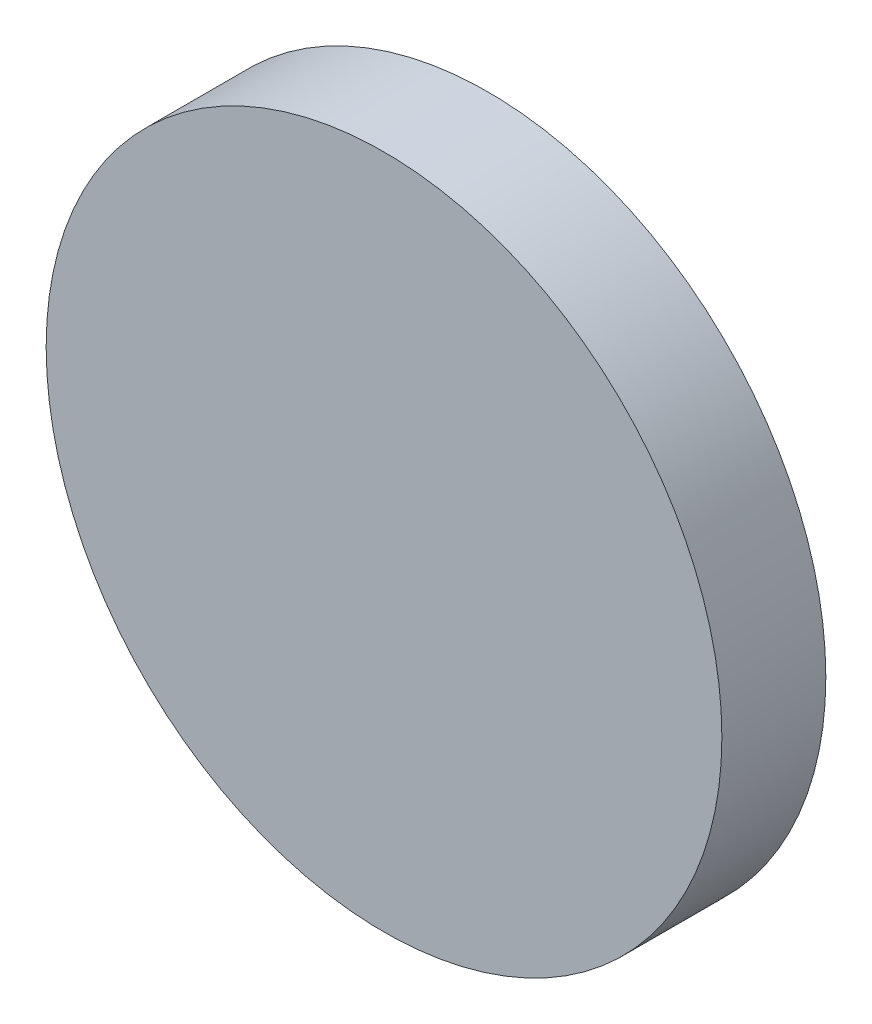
ISO-10303-21;
HEADER;
FILE_DESCRIPTION(('STEP AP214'),'2;1');
FILE_NAME('part.step','',(''),(''),'','','');
FILE_SCHEMA(('AUTOMOTIVE_DESIGN { 1 0 10303 214 1 1 1 1 }'));
ENDSEC;
DATA;
#1=APPLICATION_CONTEXT('core data for automotive mechanical design processes');
#2=APPLICATION_PROTOCOL_DEFINITION('international standard','automotive_design',2000,#1);
#3=PRODUCT_CONTEXT('',#1,'mechanical');
#4=PRODUCT('Part','Part','',(#3));
#5=PRODUCT_RELATED_PRODUCT_CATEGORY('part','',(#4));
#6=PRODUCT_DEFINITION_FORMATION('','',#4);
#7=PRODUCT_DEFINITION_CONTEXT('part definition',#1,'design');
#8=PRODUCT_DEFINITION('design','',#6,#7);
#9=PRODUCT_DEFINITION_SHAPE('','',#8);
#10=(LENGTH_UNIT() NAMED_UNIT(*) SI_UNIT(.MILLI.,.METRE.));
#11=(NAMED_UNIT(*) PLANE_ANGLE_UNIT() SI_UNIT($,.RADIAN.));
#12=(NAMED_UNIT(*) SI_UNIT($,.STERADIAN.) SOLID_ANGLE_UNIT());
#13=UNCERTAINTY_MEASURE_WITH_UNIT(LENGTH_MEASURE(1.E-05),#10,'distance_accuracy_value','');
#14=(GEOMETRIC_REPRESENTATION_CONTEXT(3) GLOBAL_UNCERTAINTY_ASSIGNED_CONTEXT((#13)) GLOBAL_UNIT_ASSIGNED_CONTEXT((#10,
#11,#12)) REPRESENTATION_CONTEXT('',''));
#15=CARTESIAN_POINT('',(0.,0.,0.));
#16=DIRECTION('',(0.,0.,1.));
#17=DIRECTION('',(1.,0.,0.));
#18=AXIS2_PLACEMENT_3D('',#15,#16,#17);
#19=CARTESIAN_POINT('',(0.,0.,2.));
#20=DIRECTION('',(0.,0.,-1.));
#21=DIRECTION('',(-1.,0.,0.));
#22=AXIS2_PLACEMENT_3D('',#19,#20,#21);
#23=CYLINDRICAL_SURFACE('',#22,6.5);
#24=CARTESIAN_POINT('',(0.,0.,2.));
#25=DIRECTION('',(0.,0.,1.));
#26=DIRECTION('',(1.,0.,0.));
#27=AXIS2_PLACEMENT_3D('',#24,#25,#26);
#28=CIRCLE('',#27,6.5);
#29=CARTESIAN_POINT('',(6.5,0.,2.));
#30=VERTEX_POINT('',#29);
#31=EDGE_CURVE('E10',#30,#30,#28,.T.);
#32=ORIENTED_EDGE('',*,*,#31,.F.);
#33=EDGE_LOOP('',(#32));
#34=FACE_BOUND('',#33,.T.);
#35=CARTESIAN_POINT('',(0.,0.,0.));
#36=DIRECTION('',(0.,0.,1.));
#37=DIRECTION('',(1.,0.,0.));
#38=AXIS2_PLACEMENT_3D('',#35,#36,#37);
#39=CIRCLE('',#38,6.5);
#40=CARTESIAN_POINT('',(6.5,0.,0.));
#41=VERTEX_POINT('',#40);
#42=EDGE_CURVE('E28',#41,#41,#39,.T.);
#43=ORIENTED_EDGE('',*,*,#42,.T.);
#44=EDGE_LOOP('',(#43));
#45=FACE_BOUND('',#44,.T.);
#46=ADVANCED_FACE('F22',(#34,#45),#23,.T.);
#47=CARTESIAN_POINT('',(0.,0.,2.));
#48=DIRECTION('',(0.,0.,1.));
#49=DIRECTION('',(1.,0.,0.));
#50=AXIS2_PLACEMENT_3D('',#47,#48,#49);
#51=PLANE('',#50);
#52=ORIENTED_EDGE('',*,*,#31,.T.);
#53=EDGE_LOOP('',(#52));
#54=FACE_BOUND('',#53,.T.);
#55=ADVANCED_FACE('F37',(#54),#51,.T.);
#56=CARTESIAN_POINT('',(0.,0.,0.));
#57=DIRECTION('',(0.,0.,1.));
#58=DIRECTION('',(1.,0.,0.));
#59=AXIS2_PLACEMENT_3D('',#56,#57,#58);
#60=PLANE('',#59);
#61=ORIENTED_EDGE('',*,*,#42,.F.);
#62=EDGE_LOOP('',(#61));
#63=FACE_BOUND('',#62,.T.);
#64=ADVANCED_FACE('F35',(#63),#60,.F.);
#65=CLOSED_SHELL('',(#46,#55,#64));
#66=MANIFOLD_SOLID_BREP('B2',#65);
#67=ADVANCED_BREP_SHAPE_REPRESENTATION('',(#18,#66),#14);
#68=SHAPE_DEFINITION_REPRESENTATION(#9,#67);
ENDSEC;
END-ISO-10303-21;
